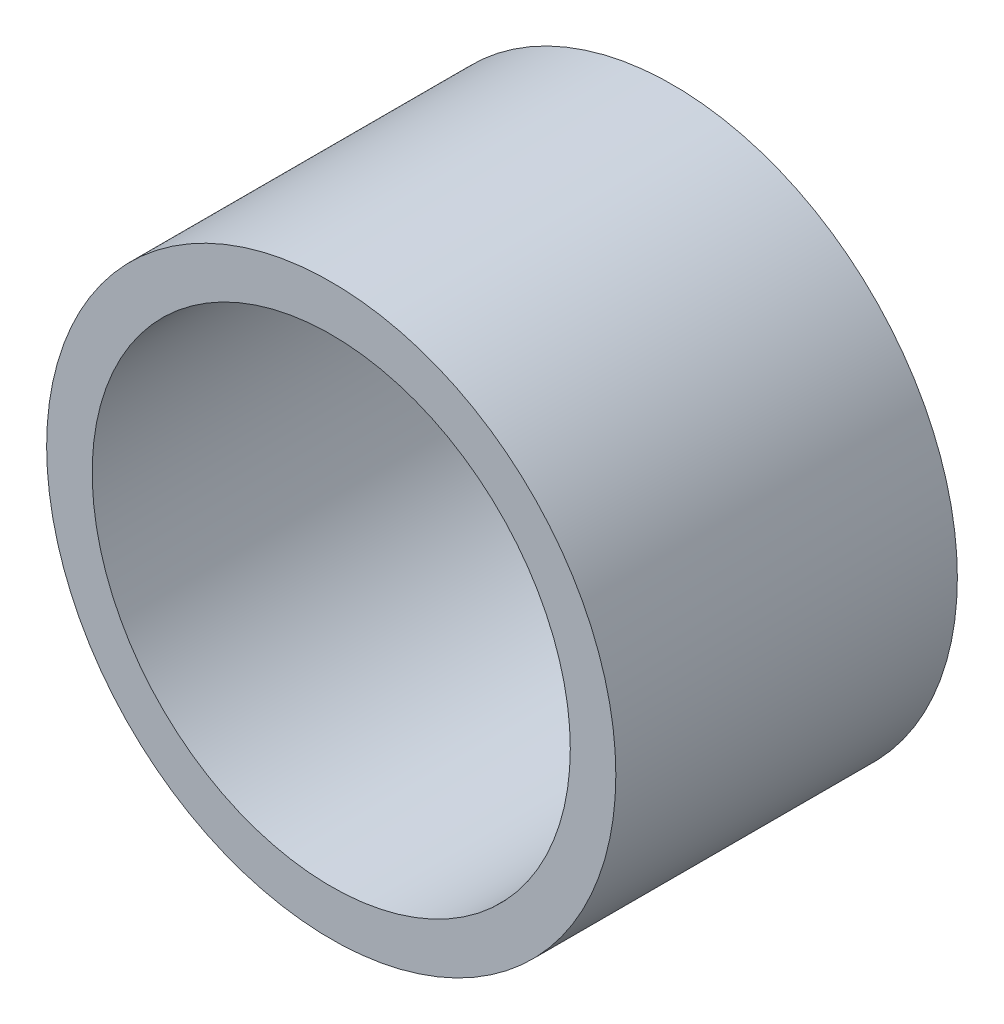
ISO-10303-21;
HEADER;
FILE_DESCRIPTION(('STEP AP214'),'2;1');
FILE_NAME('part.step','',(''),(''),'','','');
FILE_SCHEMA(('AUTOMOTIVE_DESIGN { 1 0 10303 214 1 1 1 1 }'));
ENDSEC;
DATA;
#1=APPLICATION_CONTEXT('core data for automotive mechanical design processes');
#2=APPLICATION_PROTOCOL_DEFINITION('international standard','automotive_design',2000,#1);
#3=PRODUCT_CONTEXT('',#1,'mechanical');
#4=PRODUCT('Part','Part','',(#3));
#5=PRODUCT_RELATED_PRODUCT_CATEGORY('part','',(#4));
#6=PRODUCT_DEFINITION_FORMATION('','',#4);
#7=PRODUCT_DEFINITION_CONTEXT('part definition',#1,'design');
#8=PRODUCT_DEFINITION('design','',#6,#7);
#9=PRODUCT_DEFINITION_SHAPE('','',#8);
#10=(LENGTH_UNIT() NAMED_UNIT(*) SI_UNIT(.MILLI.,.METRE.));
#11=(NAMED_UNIT(*) PLANE_ANGLE_UNIT() SI_UNIT($,.RADIAN.));
#12=(NAMED_UNIT(*) SI_UNIT($,.STERADIAN.) SOLID_ANGLE_UNIT());
#13=UNCERTAINTY_MEASURE_WITH_UNIT(LENGTH_MEASURE(1.E-05),#10,'distance_accuracy_value','');
#14=(GEOMETRIC_REPRESENTATION_CONTEXT(3) GLOBAL_UNCERTAINTY_ASSIGNED_CONTEXT((#13)) GLOBAL_UNIT_ASSIGNED_CONTEXT((#10,
#11,#12)) REPRESENTATION_CONTEXT('',''));
#15=CARTESIAN_POINT('',(0.,0.,0.));
#16=DIRECTION('',(0.,0.,1.));
#17=DIRECTION('',(1.,0.,0.));
#18=AXIS2_PLACEMENT_3D('',#15,#16,#17);
#19=CARTESIAN_POINT('',(0.,0.,15.));
#20=DIRECTION('',(0.,0.,1.));
#21=DIRECTION('',(1.,0.,0.));
#22=AXIS2_PLACEMENT_3D('',#19,#20,#21);
#23=PLANE('',#22);
#24=CARTESIAN_POINT('',(0.,0.,15.));
#25=DIRECTION('',(0.,0.,1.));
#26=DIRECTION('',(1.,0.,0.));
#27=AXIS2_PLACEMENT_3D('',#24,#25,#26);
#28=CIRCLE('',#27,12.5);
#29=CARTESIAN_POINT('',(12.5,0.,15.));
#30=VERTEX_POINT('',#29);
#31=EDGE_CURVE('E10',#30,#30,#28,.T.);
#32=ORIENTED_EDGE('',*,*,#31,.T.);
#33=EDGE_LOOP('',(#32));
#34=FACE_BOUND('',#33,.T.);
#35=CARTESIAN_POINT('',(0.,0.,15.));
#36=DIRECTION('',(0.,0.,1.));
#37=DIRECTION('',(1.,0.,0.));
#38=AXIS2_PLACEMENT_3D('',#35,#36,#37);
#39=CIRCLE('',#38,10.5);
#40=CARTESIAN_POINT('',(10.5,0.,15.));
#41=VERTEX_POINT('',#40);
#42=EDGE_CURVE('E41',#41,#41,#39,.T.);
#43=ORIENTED_EDGE('',*,*,#42,.F.);
#44=EDGE_LOOP('',(#43));
#45=FACE_BOUND('',#44,.T.);
#46=ADVANCED_FACE('F30',(#34,#45),#23,.T.);
#47=CARTESIAN_POINT('',(0.,0.,0.));
#48=DIRECTION('',(0.,0.,1.));
#49=DIRECTION('',(1.,0.,0.));
#50=AXIS2_PLACEMENT_3D('',#47,#48,#49);
#51=PLANE('',#50);
#52=CARTESIAN_POINT('',(0.,0.,0.));
#53=DIRECTION('',(0.,0.,1.));
#54=DIRECTION('',(1.,0.,0.));
#55=AXIS2_PLACEMENT_3D('',#52,#53,#54);
#56=CIRCLE('',#55,12.5);
#57=CARTESIAN_POINT('',(12.5,0.,0.));
#58=VERTEX_POINT('',#57);
#59=EDGE_CURVE('E34',#58,#58,#56,.T.);
#60=ORIENTED_EDGE('',*,*,#59,.F.);
#61=EDGE_LOOP('',(#60));
#62=FACE_BOUND('',#61,.T.);
#63=CARTESIAN_POINT('',(0.,0.,0.));
#64=DIRECTION('',(0.,0.,1.));
#65=DIRECTION('',(1.,0.,0.));
#66=AXIS2_PLACEMENT_3D('',#63,#64,#65);
#67=CIRCLE('',#66,10.5);
#68=CARTESIAN_POINT('',(10.5,0.,0.));
#69=VERTEX_POINT('',#68);
#70=EDGE_CURVE('E43',#69,#69,#67,.T.);
#71=ORIENTED_EDGE('',*,*,#70,.T.);
#72=EDGE_LOOP('',(#71));
#73=FACE_BOUND('',#72,.T.);
#74=ADVANCED_FACE('F53',(#62,#73),#51,.F.);
#75=CARTESIAN_POINT('',(0.,0.,15.));
#76=DIRECTION('',(0.,0.,-1.));
#77=DIRECTION('',(-1.,0.,0.));
#78=AXIS2_PLACEMENT_3D('',#75,#76,#77);
#79=CYLINDRICAL_SURFACE('',#78,12.5);
#80=ORIENTED_EDGE('',*,*,#31,.F.);
#81=EDGE_LOOP('',(#80));
#82=FACE_BOUND('',#81,.T.);
#83=ORIENTED_EDGE('',*,*,#59,.T.);
#84=EDGE_LOOP('',(#83));
#85=FACE_BOUND('',#84,.T.);
#86=ADVANCED_FACE('F32',(#82,#85),#79,.T.);
#87=CARTESIAN_POINT('',(0.,0.,15.));
#88=DIRECTION('',(0.,0.,-1.));
#89=DIRECTION('',(-1.,0.,0.));
#90=AXIS2_PLACEMENT_3D('',#87,#88,#89);
#91=CYLINDRICAL_SURFACE('',#90,10.5);
#92=ORIENTED_EDGE('',*,*,#42,.T.);
#93=EDGE_LOOP('',(#92));
#94=FACE_BOUND('',#93,.T.);
#95=ORIENTED_EDGE('',*,*,#70,.F.);
#96=EDGE_LOOP('',(#95));
#97=FACE_BOUND('',#96,.T.);
#98=ADVANCED_FACE('F49',(#94,#97),#91,.F.);
#99=CLOSED_SHELL('',(#46,#74,#86,#98));
#100=MANIFOLD_SOLID_BREP('B2',#99);
#101=ADVANCED_BREP_SHAPE_REPRESENTATION('',(#18,#100),#14);
#102=SHAPE_DEFINITION_REPRESENTATION(#9,#101);
ENDSEC;
END-ISO-10303-21;
